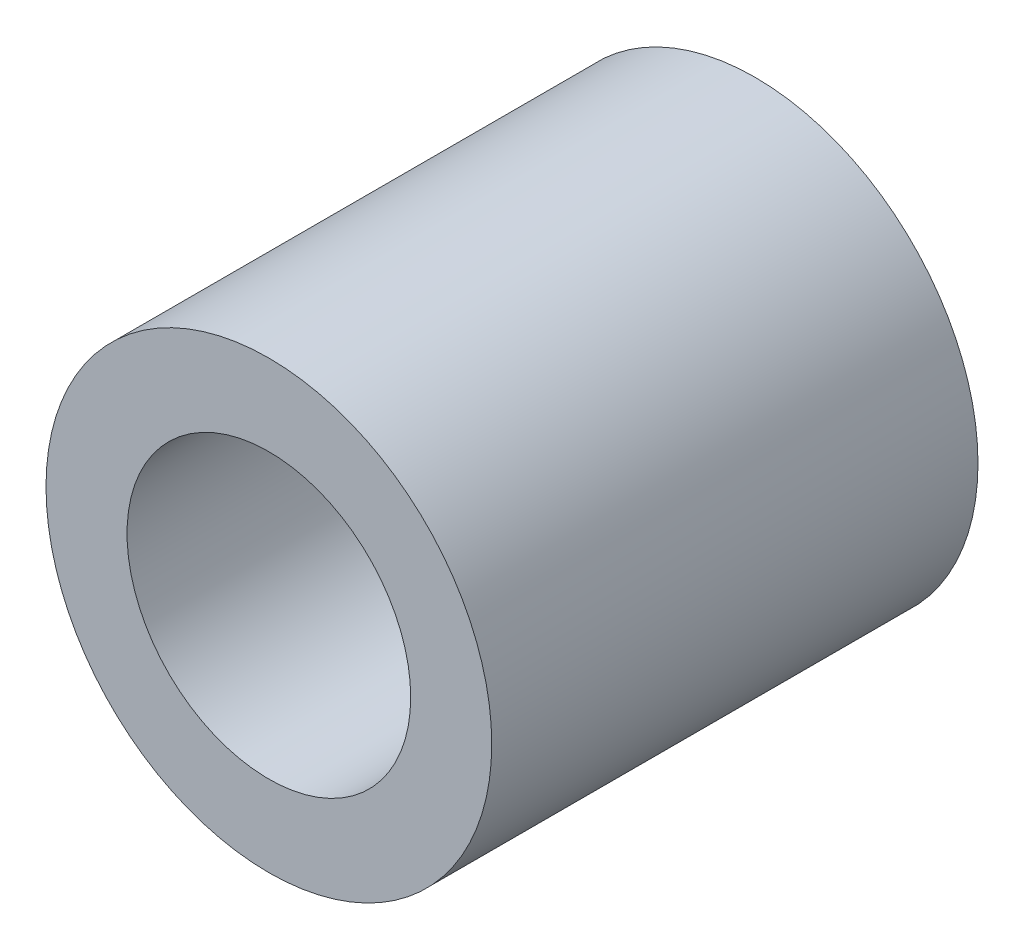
ISO-10303-21;
HEADER;
FILE_DESCRIPTION(('STEP AP214'),'2;1');
FILE_NAME('part.step','',(''),(''),'','','');
FILE_SCHEMA(('AUTOMOTIVE_DESIGN { 1 0 10303 214 1 1 1 1 }'));
ENDSEC;
DATA;
#1=APPLICATION_CONTEXT('core data for automotive mechanical design processes');
#2=APPLICATION_PROTOCOL_DEFINITION('international standard','automotive_design',2000,#1);
#3=PRODUCT_CONTEXT('',#1,'mechanical');
#4=PRODUCT('Part','Part','',(#3));
#5=PRODUCT_RELATED_PRODUCT_CATEGORY('part','',(#4));
#6=PRODUCT_DEFINITION_FORMATION('','',#4);
#7=PRODUCT_DEFINITION_CONTEXT('part definition',#1,'design');
#8=PRODUCT_DEFINITION('design','',#6,#7);
#9=PRODUCT_DEFINITION_SHAPE('','',#8);
#10=(LENGTH_UNIT() NAMED_UNIT(*) SI_UNIT(.MILLI.,.METRE.));
#11=(NAMED_UNIT(*) PLANE_ANGLE_UNIT() SI_UNIT($,.RADIAN.));
#12=(NAMED_UNIT(*) SI_UNIT($,.STERADIAN.) SOLID_ANGLE_UNIT());
#13=UNCERTAINTY_MEASURE_WITH_UNIT(LENGTH_MEASURE(1.E-05),#10,'distance_accuracy_value','');
#14=(GEOMETRIC_REPRESENTATION_CONTEXT(3) GLOBAL_UNCERTAINTY_ASSIGNED_CONTEXT((#13)) GLOBAL_UNIT_ASSIGNED_CONTEXT((#10,
#11,#12)) REPRESENTATION_CONTEXT('',''));
#15=CARTESIAN_POINT('',(0.,0.,0.));
#16=DIRECTION('',(0.,0.,1.));
#17=DIRECTION('',(1.,0.,0.));
#18=AXIS2_PLACEMENT_3D('',#15,#16,#17);
#19=CARTESIAN_POINT('',(0.,32.,18.));
#20=DIRECTION('',(0.,0.,1.));
#21=DIRECTION('',(1.,0.,0.));
#22=AXIS2_PLACEMENT_3D('',#19,#20,#21);
#23=PLANE('',#22);
#24=CARTESIAN_POINT('',(0.,32.,18.));
#25=DIRECTION('',(0.,0.,1.));
#26=DIRECTION('',(1.,0.,0.));
#27=AXIS2_PLACEMENT_3D('',#24,#25,#26);
#28=CIRCLE('',#27,11.);
#29=CARTESIAN_POINT('',(11.,32.,18.));
#30=VERTEX_POINT('',#29);
#31=EDGE_CURVE('E10',#30,#30,#28,.T.);
#32=ORIENTED_EDGE('',*,*,#31,.T.);
#33=EDGE_LOOP('',(#32));
#34=FACE_BOUND('',#33,.T.);
#35=CARTESIAN_POINT('',(0.,32.,18.));
#36=DIRECTION('',(0.,0.,1.));
#37=DIRECTION('',(1.,0.,0.));
#38=AXIS2_PLACEMENT_3D('',#35,#36,#37);
#39=CIRCLE('',#38,7.);
#40=CARTESIAN_POINT('',(7.,32.,18.));
#41=VERTEX_POINT('',#40);
#42=EDGE_CURVE('E39',#41,#41,#39,.T.);
#43=ORIENTED_EDGE('',*,*,#42,.F.);
#44=EDGE_LOOP('',(#43));
#45=FACE_BOUND('',#44,.T.);
#46=ADVANCED_FACE('F28',(#34,#45),#23,.T.);
#47=CARTESIAN_POINT('',(0.,32.,-6.));
#48=DIRECTION('',(0.,0.,1.));
#49=DIRECTION('',(1.,0.,0.));
#50=AXIS2_PLACEMENT_3D('',#47,#48,#49);
#51=PLANE('',#50);
#52=CARTESIAN_POINT('',(0.,32.,-6.));
#53=DIRECTION('',(0.,0.,1.));
#54=DIRECTION('',(1.,0.,0.));
#55=AXIS2_PLACEMENT_3D('',#52,#53,#54);
#56=CIRCLE('',#55,11.);
#57=CARTESIAN_POINT('',(11.,32.,-6.));
#58=VERTEX_POINT('',#57);
#59=EDGE_CURVE('E32',#58,#58,#56,.T.);
#60=ORIENTED_EDGE('',*,*,#59,.F.);
#61=EDGE_LOOP('',(#60));
#62=FACE_BOUND('',#61,.T.);
#63=CARTESIAN_POINT('',(0.,32.,-6.));
#64=DIRECTION('',(0.,0.,1.));
#65=DIRECTION('',(1.,0.,0.));
#66=AXIS2_PLACEMENT_3D('',#63,#64,#65);
#67=CIRCLE('',#66,7.);
#68=CARTESIAN_POINT('',(7.,32.,-6.));
#69=VERTEX_POINT('',#68);
#70=EDGE_CURVE('E41',#69,#69,#67,.T.);
#71=ORIENTED_EDGE('',*,*,#70,.T.);
#72=EDGE_LOOP('',(#71));
#73=FACE_BOUND('',#72,.T.);
#74=ADVANCED_FACE('F51',(#62,#73),#51,.F.);
#75=CARTESIAN_POINT('',(0.,32.,18.));
#76=DIRECTION('',(0.,0.,-1.));
#77=DIRECTION('',(-1.,0.,0.));
#78=AXIS2_PLACEMENT_3D('',#75,#76,#77);
#79=CYLINDRICAL_SURFACE('',#78,11.);
#80=ORIENTED_EDGE('',*,*,#31,.F.);
#81=EDGE_LOOP('',(#80));
#82=FACE_BOUND('',#81,.T.);
#83=ORIENTED_EDGE('',*,*,#59,.T.);
#84=EDGE_LOOP('',(#83));
#85=FACE_BOUND('',#84,.T.);
#86=ADVANCED_FACE('F30',(#82,#85),#79,.T.);
#87=CARTESIAN_POINT('',(0.,32.,18.));
#88=DIRECTION('',(0.,0.,-1.));
#89=DIRECTION('',(-1.,0.,0.));
#90=AXIS2_PLACEMENT_3D('',#87,#88,#89);
#91=CYLINDRICAL_SURFACE('',#90,7.);
#92=ORIENTED_EDGE('',*,*,#42,.T.);
#93=EDGE_LOOP('',(#92));
#94=FACE_BOUND('',#93,.T.);
#95=ORIENTED_EDGE('',*,*,#70,.F.);
#96=EDGE_LOOP('',(#95));
#97=FACE_BOUND('',#96,.T.);
#98=ADVANCED_FACE('F47',(#94,#97),#91,.F.);
#99=CLOSED_SHELL('',(#46,#74,#86,#98));
#100=MANIFOLD_SOLID_BREP('B2',#99);
#101=ADVANCED_BREP_SHAPE_REPRESENTATION('',(#18,#100),#14);
#102=SHAPE_DEFINITION_REPRESENTATION(#9,#101);
ENDSEC;
END-ISO-10303-21;
